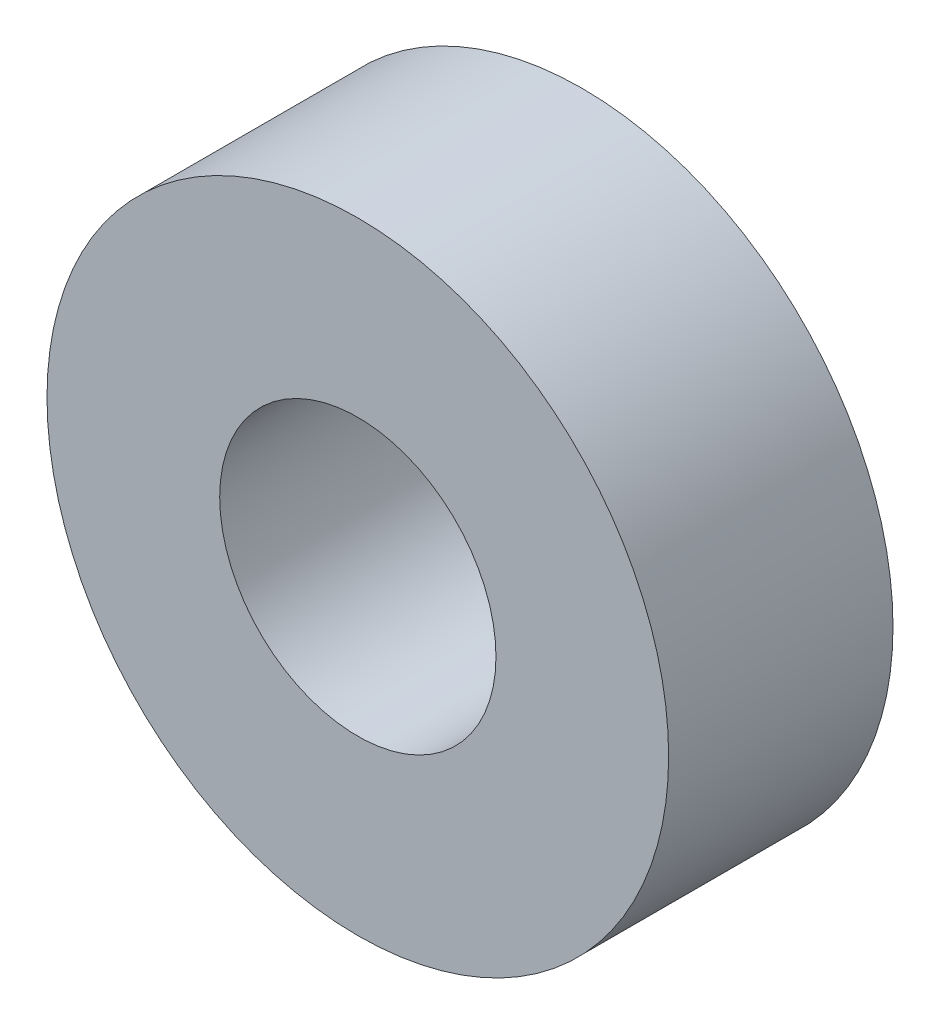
from build123d import *

# Parameters (mm, degrees)
SKETCH1_R      = 14.2875
SKETCH1_R_2    = 6.35
EXTRUDE1_DEPTH = 10.3124


with BuildPart() as part:
    # Sketch1 → Extrude1 (new body)
    with BuildSketch(Plane.XY):
        Circle(SKETCH1_R)
        Circle(SKETCH1_R_2, mode=Mode.SUBTRACT)
    extrude(amount=EXTRUDE1_DEPTH)


solid = part.part
